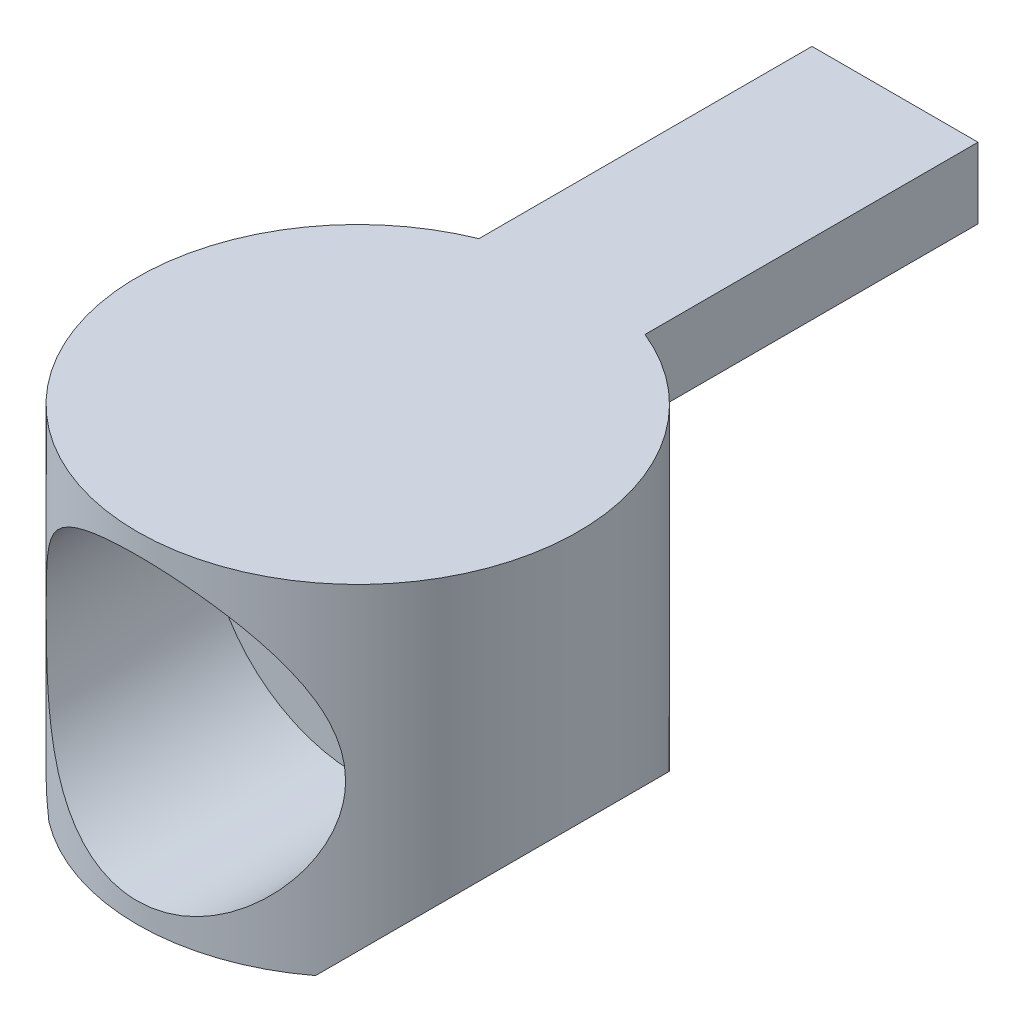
ISO-10303-21;
HEADER;
FILE_DESCRIPTION(('STEP AP214'),'2;1');
FILE_NAME('part.step','',(''),(''),'','','');
FILE_SCHEMA(('AUTOMOTIVE_DESIGN { 1 0 10303 214 1 1 1 1 }'));
ENDSEC;
DATA;
#1=APPLICATION_CONTEXT('core data for automotive mechanical design processes');
#2=APPLICATION_PROTOCOL_DEFINITION('international standard','automotive_design',2000,#1);
#3=PRODUCT_CONTEXT('',#1,'mechanical');
#4=PRODUCT('Part','Part','',(#3));
#5=PRODUCT_RELATED_PRODUCT_CATEGORY('part','',(#4));
#6=PRODUCT_DEFINITION_FORMATION('','',#4);
#7=PRODUCT_DEFINITION_CONTEXT('part definition',#1,'design');
#8=PRODUCT_DEFINITION('design','',#6,#7);
#9=PRODUCT_DEFINITION_SHAPE('','',#8);
#10=(LENGTH_UNIT() NAMED_UNIT(*) SI_UNIT(.MILLI.,.METRE.));
#11=(NAMED_UNIT(*) PLANE_ANGLE_UNIT() SI_UNIT($,.RADIAN.));
#12=(NAMED_UNIT(*) SI_UNIT($,.STERADIAN.) SOLID_ANGLE_UNIT());
#13=UNCERTAINTY_MEASURE_WITH_UNIT(LENGTH_MEASURE(1.E-05),#10,'distance_accuracy_value','');
#14=(GEOMETRIC_REPRESENTATION_CONTEXT(3) GLOBAL_UNCERTAINTY_ASSIGNED_CONTEXT((#13)) GLOBAL_UNIT_ASSIGNED_CONTEXT((#10,
#11,#12)) REPRESENTATION_CONTEXT('',''));
#15=CARTESIAN_POINT('',(0.,0.,0.));
#16=DIRECTION('',(0.,0.,1.));
#17=DIRECTION('',(1.,0.,0.));
#18=AXIS2_PLACEMENT_3D('',#15,#16,#17);
#19=CARTESIAN_POINT('',(0.,-7.9375,-25.0698));
#20=DIRECTION('',(0.,0.,1.));
#21=DIRECTION('',(1.,0.,0.));
#22=AXIS2_PLACEMENT_3D('',#19,#20,#21);
#23=CYLINDRICAL_SURFACE('',#22,4.064);
#24=CARTESIAN_POINT('',(4.064,-7.9375,-9.4501996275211));
#25=CARTESIAN_POINT('',(4.06399919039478,-8.04651797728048,-9.45020042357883));
#26=CARTESIAN_POINT('',(4.05960710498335,-8.15557113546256,-9.45209253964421));
#27=CARTESIAN_POINT('',(4.04208239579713,-8.37288984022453,-9.45959969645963));
#28=CARTESIAN_POINT('',(4.02894432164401,-8.48115485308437,-9.4652170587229));
#29=CARTESIAN_POINT('',(3.99402702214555,-8.69627166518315,-9.4800041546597));
#30=CARTESIAN_POINT('',(3.97223028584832,-8.80312014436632,-9.48918108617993));
#31=CARTESIAN_POINT('',(3.92022725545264,-9.01442920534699,-9.51078180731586));
#32=CARTESIAN_POINT('',(3.89001747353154,-9.1188887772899,-9.52320694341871));
#33=CARTESIAN_POINT('',(3.7874486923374,-9.42675938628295,-9.56467911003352));
#34=CARTESIAN_POINT('',(3.70297765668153,-9.62570831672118,-9.59800074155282));
#35=CARTESIAN_POINT('',(3.50452440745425,-10.0064578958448,-9.67221954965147));
#36=CARTESIAN_POINT('',(3.39054917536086,-10.1882625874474,-9.71311493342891));
#37=CARTESIAN_POINT('',(3.12948589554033,-10.5399466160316,-9.80043577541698));
#38=CARTESIAN_POINT('',(2.98101504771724,-10.7087582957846,-9.8470362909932));
#39=CARTESIAN_POINT('',(2.6580959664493,-11.0198569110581,-9.93906749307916));
#40=CARTESIAN_POINT('',(2.48363880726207,-11.162134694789,-9.98449777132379));
#41=CARTESIAN_POINT('',(2.10547991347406,-11.4214005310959,-10.0711626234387));
#42=CARTESIAN_POINT('',(1.90091385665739,-11.5372109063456,-10.1121697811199));
#43=CARTESIAN_POINT('',(1.47329465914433,-11.7323209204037,-10.1832531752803));
#44=CARTESIAN_POINT('',(1.25024890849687,-11.8116350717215,-10.2133337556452));
#45=CARTESIAN_POINT('',(0.803206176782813,-11.9277041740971,-10.2579367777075));
#46=CARTESIAN_POINT('',(0.579754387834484,-11.9662966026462,-10.273128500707));
#47=CARTESIAN_POINT('',(0.12906452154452,-12.0057374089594,-10.2886577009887));
#48=CARTESIAN_POINT('',(-0.0981721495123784,-12.0065995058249,-10.2890005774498));
#49=CARTESIAN_POINT('',(-0.536721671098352,-11.9715753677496,-10.2752044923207));
#50=CARTESIAN_POINT('',(-0.748224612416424,-11.9377008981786,-10.2618583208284));
#51=CARTESIAN_POINT('',(-1.16226102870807,-11.8375793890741,-10.2232465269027));
#52=CARTESIAN_POINT('',(-1.36479384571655,-11.7713299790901,-10.1979800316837));
#53=CARTESIAN_POINT('',(-1.75876535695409,-11.6075205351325,-10.1375274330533));
#54=CARTESIAN_POINT('',(-1.94999222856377,-11.5095060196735,-10.1021983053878));
#55=CARTESIAN_POINT('',(-2.31377465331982,-11.2853694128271,-10.0251405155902));
#56=CARTESIAN_POINT('',(-2.48632384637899,-11.159237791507,-9.98340968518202));
#57=CARTESIAN_POINT('',(-2.81961635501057,-10.8729992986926,-9.89463326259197));
#58=CARTESIAN_POINT('',(-2.97888947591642,-10.7112305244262,-9.84741846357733));
#59=CARTESIAN_POINT('',(-3.26863935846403,-10.3630739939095,-9.75507779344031));
#60=CARTESIAN_POINT('',(-3.39910715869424,-10.1766786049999,-9.7099525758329));
#61=CARTESIAN_POINT('',(-3.63079088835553,-9.77814410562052,-9.62576626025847));
#62=CARTESIAN_POINT('',(-3.73112301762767,-9.56544627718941,-9.58690152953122));
#63=CARTESIAN_POINT('',(-3.8939659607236,-9.12422993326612,-9.52193134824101));
#64=CARTESIAN_POINT('',(-3.95650062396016,-8.89572149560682,-9.49581785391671));
#65=CARTESIAN_POINT('',(-4.03844408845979,-8.44401177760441,-9.46124786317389));
#66=CARTESIAN_POINT('',(-4.0602132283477,-8.22131340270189,-9.4518268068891));
#67=CARTESIAN_POINT('',(-4.06687698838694,-7.77529510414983,-9.4489636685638));
#68=CARTESIAN_POINT('',(-4.05178236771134,-7.55197538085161,-9.45551692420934));
#69=CARTESIAN_POINT('',(-3.98729450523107,-7.12395373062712,-9.48287612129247));
#70=CARTESIAN_POINT('',(-3.93983256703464,-6.91890323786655,-9.50287866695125));
#71=CARTESIAN_POINT('',(-3.81444745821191,-6.51980340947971,-9.55389486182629));
#72=CARTESIAN_POINT('',(-3.73651763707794,-6.32575648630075,-9.58491091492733));
#73=CARTESIAN_POINT('',(-3.5489248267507,-5.94552569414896,-9.65597825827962));
#74=CARTESIAN_POINT('',(-3.43811772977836,-5.7599663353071,-9.69634119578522));
#75=CARTESIAN_POINT('',(-3.18909477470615,-5.40924590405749,-9.78106957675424));
#76=CARTESIAN_POINT('',(-3.05086797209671,-5.24409301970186,-9.82543661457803));
#77=CARTESIAN_POINT('',(-2.73922058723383,-4.92656716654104,-9.91701688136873));
#78=CARTESIAN_POINT('',(-2.56398695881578,-4.77596016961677,-9.96420603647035));
#79=CARTESIAN_POINT('',(-2.18959931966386,-4.50602826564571,-10.0531088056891));
#80=CARTESIAN_POINT('',(-1.99044453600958,-4.38670436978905,-10.0948222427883));
#81=CARTESIAN_POINT('',(-1.5733491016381,-4.18324538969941,-10.1681699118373));
#82=CARTESIAN_POINT('',(-1.35542676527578,-4.09907645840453,-10.1998138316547));
#83=CARTESIAN_POINT('',(-0.906962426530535,-3.96913295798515,-10.2494177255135));
#84=CARTESIAN_POINT('',(-0.676427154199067,-3.92333812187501,-10.267384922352));
#85=CARTESIAN_POINT('',(-0.225157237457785,-3.87380631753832,-10.2868564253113));
#86=CARTESIAN_POINT('',(-0.00473693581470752,-3.86757016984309,-10.2893388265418));
#87=CARTESIAN_POINT('',(0.433896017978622,-3.89076755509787,-10.28018470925));
#88=CARTESIAN_POINT('',(0.652108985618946,-3.92019591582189,-10.2685502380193));
#89=CARTESIAN_POINT('',(1.07356904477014,-4.0121056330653,-10.2329508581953));
#90=CARTESIAN_POINT('',(1.2770675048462,-4.07359001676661,-10.2093584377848));
#91=CARTESIAN_POINT('',(1.67083446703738,-4.22683026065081,-10.152354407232));
#92=CARTESIAN_POINT('',(1.86110049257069,-4.31859176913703,-10.1189409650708));
#93=CARTESIAN_POINT('',(2.23216078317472,-4.53432296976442,-10.0437660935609));
#94=CARTESIAN_POINT('',(2.41217440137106,-4.65952805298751,-10.0017029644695));
#95=CARTESIAN_POINT('',(2.74938323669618,-4.93672153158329,-9.91431568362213));
#96=CARTESIAN_POINT('',(2.90656929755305,-5.08872062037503,-9.86899023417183));
#97=CARTESIAN_POINT('',(3.20341831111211,-5.42599914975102,-9.77681369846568));
#98=CARTESIAN_POINT('',(3.34146188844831,-5.61272908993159,-9.73003447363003));
#99=CARTESIAN_POINT('',(3.5843542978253,-6.00816064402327,-9.64320857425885));
#100=CARTESIAN_POINT('',(3.68919888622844,-6.21686506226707,-9.60316276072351));
#101=CARTESIAN_POINT('',(3.85441246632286,-6.63179145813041,-9.53798290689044));
#102=CARTESIAN_POINT('',(3.91789358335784,-6.83660221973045,-9.51184366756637));
#103=CARTESIAN_POINT('',(3.98837751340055,-7.14983472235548,-9.48239491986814));
#104=CARTESIAN_POINT('',(4.00774347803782,-7.25516021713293,-9.47420805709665));
#105=CARTESIAN_POINT('',(4.03811320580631,-7.46720182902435,-9.46130530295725));
#106=CARTESIAN_POINT('',(4.04912191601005,-7.57391708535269,-9.4565873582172));
#107=CARTESIAN_POINT('',(4.05859364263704,-7.72361255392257,-9.45252302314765));
#108=CARTESIAN_POINT('',(4.06062031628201,-7.76635679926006,-9.45165243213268));
#109=CARTESIAN_POINT('',(4.06332369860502,-7.85189888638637,-9.45049055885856));
#110=CARTESIAN_POINT('',(4.06400031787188,-7.89469673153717,-9.45019931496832));
#111=CARTESIAN_POINT('',(4.064,-7.9375,-9.4501996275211));
#112=B_SPLINE_CURVE_WITH_KNOTS('',3,(#24,#25,#26,#27,#28,#29,#30,#31,#32,#33,#34,#35,#36,#37,
#38,#39,#40,#41,#42,#43,#44,#45,#46,#47,#48,#49,#50,#51,#52,#53,#54,#55,#56,#57,#58,#59,#60,#61,
#62,#63,#64,#65,#66,#67,#68,#69,#70,#71,#72,#73,#74,#75,#76,#77,#78,#79,#80,#81,#82,#83,#84,#85,
#86,#87,#88,#89,#90,#91,#92,#93,#94,#95,#96,#97,#98,#99,#100,#101,#102,#103,#104,#105,#106,#107,
#108,#109,#110,#111),.UNSPECIFIED.,.T.,.F.,(4,2,2,2,2,2,2,2,2,2,2,2,2,2,2,2,2,2,2,2,2,2,2,2,2,2,
2,2,2,2,2,2,2,2,2,2,2,2,2,2,2,2,2,4),(0.,0.327009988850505,0.654223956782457,0.98210306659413,
1.31011830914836,1.96300003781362,2.61572741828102,3.30145586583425,3.98742039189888,
4.69966446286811,5.41162506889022,6.08987183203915,6.76787197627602,7.4087076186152,
8.0495901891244,8.70008005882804,9.35079073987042,10.0432975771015,10.7360195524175,
11.4474238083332,12.1583787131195,12.8267179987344,13.4948622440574,14.1262730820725,
14.7578218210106,15.4146193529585,16.0716795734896,16.7758621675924,17.4800675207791,
18.1835932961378,18.8867472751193,19.5449955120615,20.2031482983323,20.8419555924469,
21.4808821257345,22.1478124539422,22.8150095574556,23.5222773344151,24.2296354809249,
24.8744687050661,25.1963623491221,25.5180652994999,25.6464493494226,25.77484190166),.UNSPECIFIED.);
#113=CARTESIAN_POINT('',(4.064,-7.9375,-9.4501996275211));
#114=VERTEX_POINT('',#113);
#115=EDGE_CURVE('E420',#114,#114,#112,.T.);
#116=ORIENTED_EDGE('',*,*,#115,.T.);
#117=EDGE_LOOP('',(#116));
#118=FACE_BOUND('',#117,.T.);
#119=CARTESIAN_POINT('',(0.,-7.9375,0.0508000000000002));
#120=DIRECTION('',(0.,0.,1.));
#121=DIRECTION('',(1.,0.,0.));
#122=AXIS2_PLACEMENT_3D('',#119,#120,#121);
#123=CIRCLE('',#122,4.064);
#124=CARTESIAN_POINT('',(4.064,-7.9375,0.0508000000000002));
#125=VERTEX_POINT('',#124);
#126=EDGE_CURVE('E441',#125,#125,#123,.F.);
#127=ORIENTED_EDGE('',*,*,#126,.F.);
#128=EDGE_LOOP('',(#127));
#129=FACE_BOUND('',#128,.T.);
#130=ADVANCED_FACE('F361',(#118,#129),#23,.F.);
#131=CARTESIAN_POINT('',(0.,-15.875,0.));
#132=DIRECTION('',(0.,1.,0.));
#133=DIRECTION('',(0.,0.,1.));
#134=AXIS2_PLACEMENT_3D('',#131,#132,#133);
#135=CYLINDRICAL_SURFACE('',#134,10.287);
#136=CARTESIAN_POINT('',(0.,-14.9225,10.287));
#137=CARTESIAN_POINT('',(0.174767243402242,-14.9224992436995,10.2869992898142));
#138=CARTESIAN_POINT('',(0.349546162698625,-14.9159313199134,10.2825363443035));
#139=CARTESIAN_POINT('',(0.697678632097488,-14.8897621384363,10.2647942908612));
#140=CARTESIAN_POINT('',(0.871032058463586,-14.8701597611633,10.2515144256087));
#141=CARTESIAN_POINT('',(1.21504561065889,-14.8182098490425,10.2164545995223));
#142=CARTESIAN_POINT('',(1.38570408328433,-14.7858547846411,10.1946696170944));
#143=CARTESIAN_POINT('',(1.72298267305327,-14.7088723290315,10.1431164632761));
#144=CARTESIAN_POINT('',(1.88960281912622,-14.6642450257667,10.113348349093));
#145=CARTESIAN_POINT('',(2.21690261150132,-14.5635641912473,10.0466638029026));
#146=CARTESIAN_POINT('',(2.37760846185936,-14.5075707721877,10.0097850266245));
#147=CARTESIAN_POINT('',(2.69314305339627,-14.3846631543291,9.92954683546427));
#148=CARTESIAN_POINT('',(2.84796947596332,-14.3177447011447,9.8861848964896));
#149=CARTESIAN_POINT('',(3.30239515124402,-14.1016508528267,9.74764553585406));
#150=CARTESIAN_POINT('',(3.59223487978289,-13.9370450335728,9.64395234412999));
#151=CARTESIAN_POINT('',(4.1651402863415,-13.5562544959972,9.41157959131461));
#152=CARTESIAN_POINT('',(4.44546680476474,-13.3368461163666,9.28151649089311));
#153=CARTESIAN_POINT('',(4.96803495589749,-12.8603089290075,9.01262083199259));
#154=CARTESIAN_POINT('',(5.21021988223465,-12.6031250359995,8.87377563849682));
#155=CARTESIAN_POINT('',(5.5609178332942,-12.1693538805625,8.6557362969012));
#156=CARTESIAN_POINT('',(5.68303836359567,-12.0039192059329,8.57582806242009));
#157=CARTESIAN_POINT('',(5.91286413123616,-11.661841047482,8.41901001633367));
#158=CARTESIAN_POINT('',(6.02056592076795,-11.4851948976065,8.34210092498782));
#159=CARTESIAN_POINT('',(6.22056332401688,-11.1214954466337,8.194048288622));
#160=CARTESIAN_POINT('',(6.31288352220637,-10.9344594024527,8.1228956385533));
#161=CARTESIAN_POINT('',(6.48135067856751,-10.5502171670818,7.98911997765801));
#162=CARTESIAN_POINT('',(6.55749732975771,-10.3530107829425,7.92649712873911));
#163=CARTESIAN_POINT('',(6.67227625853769,-10.0095263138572,7.82987459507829));
#164=CARTESIAN_POINT('',(6.71532978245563,-9.86554956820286,7.79290183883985));
#165=CARTESIAN_POINT('',(6.79235459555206,-9.57362814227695,7.72585902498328));
#166=CARTESIAN_POINT('',(6.82632846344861,-9.42568460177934,7.69578700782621));
#167=CARTESIAN_POINT('',(6.88469686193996,-9.12675532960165,7.64361521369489));
#168=CARTESIAN_POINT('',(6.90910551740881,-8.97577443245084,7.62150368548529));
#169=CARTESIAN_POINT('',(6.94801959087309,-8.67150763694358,7.58604574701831));
#170=CARTESIAN_POINT('',(6.96252497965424,-8.51822173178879,7.57269936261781));
#171=CARTESIAN_POINT('',(6.98140988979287,-8.20976177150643,7.55529311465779));
#172=CARTESIAN_POINT('',(6.98574108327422,-8.0545822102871,7.55127757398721));
#173=CARTESIAN_POINT('',(6.98405171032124,-7.74433031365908,7.55283992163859));
#174=CARTESIAN_POINT('',(6.97803113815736,-7.58925797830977,7.55841781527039));
#175=CARTESIAN_POINT('',(6.95574608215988,-7.28038020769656,7.57893097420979));
#176=CARTESIAN_POINT('',(6.93947521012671,-7.12657562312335,7.5938720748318));
#177=CARTESIAN_POINT('',(6.89699243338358,-6.82149335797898,7.63247480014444));
#178=CARTESIAN_POINT('',(6.87078030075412,-6.67021573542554,7.65613662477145));
#179=CARTESIAN_POINT('',(6.7810629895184,-6.23718647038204,7.73600755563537));
#180=CARTESIAN_POINT('',(6.70517296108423,-5.95977724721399,7.80239699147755));
#181=CARTESIAN_POINT('',(6.52235681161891,-5.42152088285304,7.95583678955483));
#182=CARTESIAN_POINT('',(6.41540667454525,-5.16068674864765,8.04290312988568));
#183=CARTESIAN_POINT('',(6.20438735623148,-4.72208380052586,8.20615188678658));
#184=CARTESIAN_POINT('',(6.10658965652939,-4.54014421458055,8.27941465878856));
#185=CARTESIAN_POINT('',(5.89623565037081,-4.18691309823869,8.43051235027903));
#186=CARTESIAN_POINT('',(5.78367390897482,-4.01562552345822,8.50834894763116));
#187=CARTESIAN_POINT('',(5.54430317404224,-3.68393348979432,8.66623725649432));
#188=CARTESIAN_POINT('',(5.41747098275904,-3.52354745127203,8.74629241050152));
#189=CARTESIAN_POINT('',(5.15023849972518,-3.21447184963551,8.90627092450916));
#190=CARTESIAN_POINT('',(5.0098397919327,-3.06578092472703,8.98619429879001));
#191=CARTESIAN_POINT('',(4.71463843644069,-2.77949194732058,9.14455310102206));
#192=CARTESIAN_POINT('',(4.55972184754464,-2.64200080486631,9.22296971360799));
#193=CARTESIAN_POINT('',(4.23699414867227,-2.38041020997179,9.37561258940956));
#194=CARTESIAN_POINT('',(4.06918191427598,-2.256311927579,9.44983848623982));
#195=CARTESIAN_POINT('',(3.72160444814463,-2.02280311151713,9.59203967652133));
#196=CARTESIAN_POINT('',(3.54186107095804,-1.91336677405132,9.66002588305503));
#197=CARTESIAN_POINT('',(3.17103463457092,-1.71018713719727,9.78802047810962));
#198=CARTESIAN_POINT('',(2.9799550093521,-1.61643911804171,9.84803126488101));
#199=CARTESIAN_POINT('',(2.63115393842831,-1.46486728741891,9.94608300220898));
#200=CARTESIAN_POINT('',(2.47542306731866,-1.40368625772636,9.986045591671));
#201=CARTESIAN_POINT('',(2.15857566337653,-1.29227903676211,10.0592913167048));
#202=CARTESIAN_POINT('',(1.99746019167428,-1.2420507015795,10.0925757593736));
#203=CARTESIAN_POINT('',(1.67081859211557,-1.15316329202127,10.1517618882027));
#204=CARTESIAN_POINT('',(1.50529460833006,-1.1144987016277,10.1776670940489));
#205=CARTESIAN_POINT('',(1.17083806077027,-1.04922076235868,10.221543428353));
#206=CARTESIAN_POINT('',(1.00190541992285,-1.02260768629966,10.2395143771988));
#207=CARTESIAN_POINT('',(0.661287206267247,-0.98175099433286,10.2671495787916));
#208=CARTESIAN_POINT('',(0.489594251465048,-0.967549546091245,10.2767855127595));
#209=CARTESIAN_POINT('',(0.145358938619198,-0.951887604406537,10.2874142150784));
#210=CARTESIAN_POINT('',(-0.0271834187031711,-0.950427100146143,10.2884069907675));
#211=CARTESIAN_POINT('',(-0.371741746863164,-0.960269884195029,10.2817251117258));
#212=CARTESIAN_POINT('',(-0.543757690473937,-0.971573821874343,10.2740500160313));
#213=CARTESIAN_POINT('',(-0.885895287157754,-1.00677217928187,10.2502177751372));
#214=CARTESIAN_POINT('',(-1.05601698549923,-1.03066629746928,10.2340608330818));
#215=CARTESIAN_POINT('',(-1.38417793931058,-1.08910088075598,10.1947179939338));
#216=CARTESIAN_POINT('',(-1.54238036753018,-1.12301147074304,10.1719490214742));
#217=CARTESIAN_POINT('',(-1.85504509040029,-1.20140181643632,10.1196003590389));
#218=CARTESIAN_POINT('',(-2.00950608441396,-1.24588519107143,10.0900183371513));
#219=CARTESIAN_POINT('',(-2.31375718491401,-1.34490257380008,10.0246248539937));
#220=CARTESIAN_POINT('',(-2.46354859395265,-1.39943374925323,9.98881514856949));
#221=CARTESIAN_POINT('',(-2.7578701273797,-1.51803228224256,9.91159345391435));
#222=CARTESIAN_POINT('',(-2.90239821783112,-1.58210327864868,9.8701793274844));
#223=CARTESIAN_POINT('',(-3.19701314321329,-1.72475283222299,9.77891220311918));
#224=CARTESIAN_POINT('',(-3.34660853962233,-1.80408460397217,9.72864801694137));
#225=CARTESIAN_POINT('',(-3.63841798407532,-1.97255581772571,9.62332553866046));
#226=CARTESIAN_POINT('',(-3.78062927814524,-2.06169888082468,9.56826547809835));
#227=CARTESIAN_POINT('',(-4.19565569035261,-2.34300779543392,9.39724356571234));
#228=CARTESIAN_POINT('',(-4.4568974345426,-2.54907005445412,9.27542907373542));
#229=CARTESIAN_POINT('',(-4.8437102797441,-2.90103856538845,9.07671061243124));
#230=CARTESIAN_POINT('',(-4.98051214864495,-3.03631108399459,9.00220374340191));
#231=CARTESIAN_POINT('',(-5.24235254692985,-3.31745278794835,8.85227786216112));
#232=CARTESIAN_POINT('',(-5.36738923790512,-3.46332362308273,8.77685870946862));
#233=CARTESIAN_POINT('',(-5.60529644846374,-3.7652280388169,8.62686631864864));
#234=CARTESIAN_POINT('',(-5.71815944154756,-3.92126781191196,8.55229362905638));
#235=CARTESIAN_POINT('',(-5.93111593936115,-4.2430069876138,8.40600401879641));
#236=CARTESIAN_POINT('',(-6.03121553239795,-4.40870172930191,8.33428574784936));
#237=CARTESIAN_POINT('',(-6.20487180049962,-4.72539188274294,8.2056026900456));
#238=CARTESIAN_POINT('',(-6.28018073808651,-4.87516177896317,8.14798416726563));
#239=CARTESIAN_POINT('',(-6.42045256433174,-5.18134926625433,8.03791678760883));
#240=CARTESIAN_POINT('',(-6.48541459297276,-5.33776740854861,7.98546836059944));
#241=CARTESIAN_POINT('',(-6.60427965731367,-5.65657643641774,7.88744505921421));
#242=CARTESIAN_POINT('',(-6.65819890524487,-5.81895814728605,7.84186013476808));
#243=CARTESIAN_POINT('',(-6.75438025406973,-6.14917349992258,7.75917176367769));
#244=CARTESIAN_POINT('',(-6.79664942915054,-6.31700376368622,7.72206317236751));
#245=CARTESIAN_POINT('',(-6.86300111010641,-6.62957667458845,7.66310777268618));
#246=CARTESIAN_POINT('',(-6.88892163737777,-6.77364733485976,7.63976164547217));
#247=CARTESIAN_POINT('',(-6.93173586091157,-7.06411769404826,7.60093723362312));
#248=CARTESIAN_POINT('',(-6.9486339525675,-7.21051622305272,7.5854551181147));
#249=CARTESIAN_POINT('',(-6.97313717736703,-7.50466111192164,7.5629363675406));
#250=CARTESIAN_POINT('',(-6.98074737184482,-7.65240669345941,7.55589513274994));
#251=CARTESIAN_POINT('',(-6.98655849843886,-7.94824548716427,7.55052213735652));
#252=CARTESIAN_POINT('',(-6.98475923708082,-8.09633870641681,7.55219055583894));
#253=CARTESIAN_POINT('',(-6.97178530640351,-8.39165756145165,7.5641694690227));
#254=CARTESIAN_POINT('',(-6.96061725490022,-8.5388837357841,7.57447386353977));
#255=CARTESIAN_POINT('',(-6.92911652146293,-8.83150772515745,7.60329842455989));
#256=CARTESIAN_POINT('',(-6.90878390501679,-8.97690555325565,7.62181853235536));
#257=CARTESIAN_POINT('',(-6.83443640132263,-9.40928699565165,7.68878634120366));
#258=CARTESIAN_POINT('',(-6.76707917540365,-9.69230256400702,7.74863407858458));
#259=CARTESIAN_POINT('',(-6.57315914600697,-10.330901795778,7.91433514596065));
#260=CARTESIAN_POINT('',(-6.4345219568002,-10.6805492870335,8.02879421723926));
#261=CARTESIAN_POINT('',(-6.18960112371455,-11.179970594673,8.21717171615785));
#262=CARTESIAN_POINT('',(-6.10167863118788,-11.3424402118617,8.28283008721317));
#263=CARTESIAN_POINT('',(-5.91401497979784,-11.6588496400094,8.41784603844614));
#264=CARTESIAN_POINT('',(-5.81427463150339,-11.8127900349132,8.4872033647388));
#265=CARTESIAN_POINT('',(-5.6014025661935,-12.1147392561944,8.6292155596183));
#266=CARTESIAN_POINT('',(-5.48804444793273,-12.2625698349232,8.70190854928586));
#267=CARTESIAN_POINT('',(-5.24994334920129,-12.548677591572,8.84759554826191));
#268=CARTESIAN_POINT('',(-5.12519751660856,-12.6869523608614,8.92058962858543));
#269=CARTESIAN_POINT('',(-4.86467510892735,-12.9534633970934,9.06529152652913));
#270=CARTESIAN_POINT('',(-4.72889719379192,-13.0816984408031,9.13699918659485));
#271=CARTESIAN_POINT('',(-4.44665036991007,-13.3275422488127,9.27763637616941));
#272=CARTESIAN_POINT('',(-4.30017984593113,-13.4451494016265,9.34656548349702));
#273=CARTESIAN_POINT('',(-3.97818675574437,-13.6828541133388,9.48846941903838));
#274=CARTESIAN_POINT('',(-3.8013116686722,-13.8014602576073,9.56089002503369));
#275=CARTESIAN_POINT('',(-3.43542512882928,-14.0230393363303,9.69837051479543));
#276=CARTESIAN_POINT('',(-3.24641963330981,-14.1260198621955,9.763433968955));
#277=CARTESIAN_POINT('',(-2.8575541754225,-14.3149024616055,9.88423713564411));
#278=CARTESIAN_POINT('',(-2.65771034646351,-14.4008290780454,9.93999022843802));
#279=CARTESIAN_POINT('',(-2.24846359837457,-14.5543221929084,10.0404735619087));
#280=CARTESIAN_POINT('',(-2.03906522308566,-14.6218973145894,10.0852089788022));
#281=CARTESIAN_POINT('',(-1.67871039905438,-14.7194938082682,10.1502074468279));
#282=CARTESIAN_POINT('',(-1.5297176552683,-14.7546654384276,10.1737597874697));
#283=CARTESIAN_POINT('',(-1.22891015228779,-14.815255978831,10.2144585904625));
#284=CARTESIAN_POINT('',(-1.07709593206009,-14.8406767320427,10.2316062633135));
#285=CARTESIAN_POINT('',(-0.771540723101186,-14.8814689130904,10.2591726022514));
#286=CARTESIAN_POINT('',(-0.617800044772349,-14.896841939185,10.2695923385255));
#287=CARTESIAN_POINT('',(-0.309375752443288,-14.9173562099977,10.2835052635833));
#288=CARTESIAN_POINT('',(-0.154692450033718,-14.9225006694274,10.2870006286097));
#289=CARTESIAN_POINT('',(0.,-14.9225,10.287));
#290=B_SPLINE_CURVE_WITH_KNOTS('',3,(#136,#137,#138,#139,#140,#141,#142,#143,#144,#145,#146,
#147,#148,#149,#150,#151,#152,#153,#154,#155,#156,#157,#158,#159,#160,#161,#162,#163,#164,#165,
#166,#167,#168,#169,#170,#171,#172,#173,#174,#175,#176,#177,#178,#179,#180,#181,#182,#183,#184,
#185,#186,#187,#188,#189,#190,#191,#192,#193,#194,#195,#196,#197,#198,#199,#200,#201,#202,#203,
#204,#205,#206,#207,#208,#209,#210,#211,#212,#213,#214,#215,#216,#217,#218,#219,#220,#221,#222,
#223,#224,#225,#226,#227,#228,#229,#230,#231,#232,#233,#234,#235,#236,#237,#238,#239,#240,#241,
#242,#243,#244,#245,#246,#247,#248,#249,#250,#251,#252,#253,#254,#255,#256,#257,#258,#259,#260,
#261,#262,#263,#264,#265,#266,#267,#268,#269,#270,#271,#272,#273,#274,#275,#276,#277,#278,#279,
#280,#281,#282,#283,#284,#285,#286,#287,#288,#289),.UNSPECIFIED.,.T.,.F.,(4,2,2,2,2,2,2,2,2,2,2,
2,2,2,2,2,2,2,2,2,2,2,2,2,2,2,2,2,2,2,2,2,2,2,2,2,2,2,2,2,2,2,2,2,2,2,2,2,2,2,2,2,2,2,2,2,2,2,2,
2,2,2,2,2,2,2,2,2,2,2,2,2,2,2,2,2,4),(0.,0.524143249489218,1.04833152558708,1.57282976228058,
2.09732424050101,2.61911388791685,3.14110721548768,4.18416131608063,5.31715608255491,
6.45181972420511,7.1129904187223,7.77431893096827,8.43458008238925,9.09485376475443,
9.55871083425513,10.022436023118,10.4854738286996,10.9485130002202,11.4137472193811,
11.8789816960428,12.3445064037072,12.8100417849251,13.6920305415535,14.5747030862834,
15.2314127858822,15.8883649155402,16.5464008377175,17.2043600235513,17.8680024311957,
18.5317027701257,19.1942192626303,19.8565360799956,20.3720901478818,20.8875432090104,
21.4027500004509,21.9179684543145,22.4349305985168,22.9518923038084,23.4688803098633,
23.985855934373,24.4754906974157,24.9652932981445,25.4549580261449,25.944810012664,
26.4741597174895,27.0037054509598,28.0626795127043,28.6811363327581,29.2996896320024,
29.9186231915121,30.5372603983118,31.068593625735,31.5999709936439,32.1305625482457,
32.6608312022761,33.1050669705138,33.5490861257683,33.9928632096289,34.4366494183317,
34.8801224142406,35.3235922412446,36.2109950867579,37.383808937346,37.9715571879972,
38.5592651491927,39.1586317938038,39.7581489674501,40.3577390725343,40.9574199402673,
41.6312788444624,42.3048093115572,42.9773633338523,43.6496007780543,44.1138453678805,
44.5780021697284,45.0420851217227,45.5060221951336),.UNSPECIFIED.);
#291=CARTESIAN_POINT('',(0.,-14.9225,10.287));
#292=VERTEX_POINT('',#291);
#293=EDGE_CURVE('E12',#292,#292,#290,.T.);
#294=ORIENTED_EDGE('',*,*,#293,.F.);
#295=EDGE_LOOP('',(#294));
#296=FACE_BOUND('',#295,.T.);
#297=ORIENTED_EDGE('',*,*,#115,.F.);
#298=EDGE_LOOP('',(#297));
#299=FACE_BOUND('',#298,.T.);
#300=CARTESIAN_POINT('',(0.,-22.098,0.));
#301=DIRECTION('',(0.707106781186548,0.707106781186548,0.));
#302=DIRECTION('',(-0.707106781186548,0.707106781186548,0.));
#303=AXIS2_PLACEMENT_3D('',#300,#301,#302);
#304=ELLIPSE('',#303,14.548014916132,10.287);
#305=CARTESIAN_POINT('',(-6.223,-15.875,8.19125387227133));
#306=VERTEX_POINT('',#305);
#307=CARTESIAN_POINT('',(-6.223,-15.875,-8.19125387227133));
#308=VERTEX_POINT('',#307);
#309=EDGE_CURVE('E379',#306,#308,#304,.F.);
#310=ORIENTED_EDGE('',*,*,#309,.F.);
#311=CARTESIAN_POINT('',(0.,-15.875,0.));
#312=DIRECTION('',(0.,1.,0.));
#313=DIRECTION('',(0.,0.,1.));
#314=AXIS2_PLACEMENT_3D('',#311,#312,#313);
#315=CIRCLE('',#314,10.287);
#316=CARTESIAN_POINT('',(6.223,-15.875,8.19125387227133));
#317=VERTEX_POINT('',#316);
#318=EDGE_CURVE('E386',#306,#317,#315,.T.);
#319=ORIENTED_EDGE('',*,*,#318,.T.);
#320=CARTESIAN_POINT('',(0.,-22.098,0.));
#321=DIRECTION('',(-0.707106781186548,0.707106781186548,0.));
#322=DIRECTION('',(0.707106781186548,0.707106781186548,0.));
#323=AXIS2_PLACEMENT_3D('',#320,#321,#322);
#324=ELLIPSE('',#323,14.548014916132,10.287);
#325=CARTESIAN_POINT('',(6.223,-15.875,-8.19125387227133));
#326=VERTEX_POINT('',#325);
#327=EDGE_CURVE('E419',#326,#317,#324,.F.);
#328=ORIENTED_EDGE('',*,*,#327,.F.);
#329=EDGE_CURVE('E418',#326,#308,#315,.T.);
#330=ORIENTED_EDGE('',*,*,#329,.T.);
#331=EDGE_LOOP('',(#310,#319,#328,#330));
#332=FACE_BOUND('',#331,.T.);
#333=DIRECTION('',(0.,1.,0.));
#334=VECTOR('',#333,1.);
#335=CARTESIAN_POINT('',(-3.8735,-3.302,-9.52986708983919));
#336=LINE('',#335,#334);
#337=CARTESIAN_POINT('',(-3.8735,-3.302,-9.52986708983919));
#338=VERTEX_POINT('',#337);
#339=CARTESIAN_POINT('',(-3.8735,0.,-9.52986708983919));
#340=VERTEX_POINT('',#339);
#341=EDGE_CURVE('E432',#338,#340,#336,.T.);
#342=ORIENTED_EDGE('',*,*,#341,.F.);
#343=CARTESIAN_POINT('',(0.,-3.302,0.));
#344=DIRECTION('',(0.,-1.,0.));
#345=DIRECTION('',(0.,0.,1.));
#346=AXIS2_PLACEMENT_3D('',#343,#344,#345);
#347=CIRCLE('',#346,10.287);
#348=CARTESIAN_POINT('',(3.8735,-3.302,-9.52986708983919));
#349=VERTEX_POINT('',#348);
#350=EDGE_CURVE('E505',#338,#349,#347,.T.);
#351=ORIENTED_EDGE('',*,*,#350,.T.);
#352=DIRECTION('',(0.,1.,0.));
#353=VECTOR('',#352,1.);
#354=CARTESIAN_POINT('',(3.8735,-3.302,-9.52986708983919));
#355=LINE('',#354,#353);
#356=CARTESIAN_POINT('',(3.8735,0.,-9.52986708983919));
#357=VERTEX_POINT('',#356);
#358=EDGE_CURVE('E517',#349,#357,#355,.T.);
#359=ORIENTED_EDGE('',*,*,#358,.T.);
#360=CARTESIAN_POINT('',(0.,0.,0.));
#361=DIRECTION('',(0.,1.,0.));
#362=DIRECTION('',(0.,0.,1.));
#363=AXIS2_PLACEMENT_3D('',#360,#361,#362);
#364=CIRCLE('',#363,10.287);
#365=EDGE_CURVE('E429',#340,#357,#364,.T.);
#366=ORIENTED_EDGE('',*,*,#365,.F.);
#367=EDGE_LOOP('',(#342,#351,#359,#366));
#368=FACE_BOUND('',#367,.T.);
#369=ADVANCED_FACE('F363',(#296,#299,#332,#368),#135,.T.);
#370=CARTESIAN_POINT('',(0.,-15.875,0.));
#371=DIRECTION('',(0.,1.,0.));
#372=DIRECTION('',(0.,0.,1.));
#373=AXIS2_PLACEMENT_3D('',#370,#371,#372);
#374=PLANE('',#373);
#375=ORIENTED_EDGE('',*,*,#318,.F.);
#376=DIRECTION('',(0.,0.,-1.));
#377=VECTOR('',#376,1.);
#378=CARTESIAN_POINT('',(-6.223,-15.875,0.));
#379=LINE('',#378,#377);
#380=EDGE_CURVE('E373',#306,#308,#379,.T.);
#381=ORIENTED_EDGE('',*,*,#380,.T.);
#382=ORIENTED_EDGE('',*,*,#329,.F.);
#383=DIRECTION('',(0.,0.,1.));
#384=VECTOR('',#383,1.);
#385=CARTESIAN_POINT('',(6.223,-15.875,0.));
#386=LINE('',#385,#384);
#387=EDGE_CURVE('E424',#326,#317,#386,.T.);
#388=ORIENTED_EDGE('',*,*,#387,.T.);
#389=EDGE_LOOP('',(#375,#381,#382,#388));
#390=FACE_BOUND('',#389,.T.);
#391=ADVANCED_FACE('F427',(#390),#374,.F.);
#392=CARTESIAN_POINT('',(0.,0.,0.));
#393=DIRECTION('',(0.,1.,0.));
#394=DIRECTION('',(0.,0.,1.));
#395=AXIS2_PLACEMENT_3D('',#392,#393,#394);
#396=PLANE('',#395);
#397=ORIENTED_EDGE('',*,*,#365,.T.);
#398=DIRECTION('',(0.,0.,-1.));
#399=VECTOR('',#398,1.);
#400=CARTESIAN_POINT('',(3.8735,0.,-25.0698));
#401=LINE('',#400,#399);
#402=CARTESIAN_POINT('',(3.8735,0.,-25.0698));
#403=VERTEX_POINT('',#402);
#404=EDGE_CURVE('E497',#357,#403,#401,.T.);
#405=ORIENTED_EDGE('',*,*,#404,.T.);
#406=DIRECTION('',(-1.,0.,0.));
#407=VECTOR('',#406,1.);
#408=CARTESIAN_POINT('',(-3.8735,0.,-25.0698));
#409=LINE('',#408,#407);
#410=CARTESIAN_POINT('',(-3.8735,0.,-25.0698));
#411=VERTEX_POINT('',#410);
#412=EDGE_CURVE('E500',#403,#411,#409,.T.);
#413=ORIENTED_EDGE('',*,*,#412,.T.);
#414=DIRECTION('',(0.,0.,1.));
#415=VECTOR('',#414,1.);
#416=CARTESIAN_POINT('',(-3.8735,0.,-9.52986708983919));
#417=LINE('',#416,#415);
#418=EDGE_CURVE('E503',#411,#340,#417,.T.);
#419=ORIENTED_EDGE('',*,*,#418,.T.);
#420=EDGE_LOOP('',(#397,#405,#413,#419));
#421=FACE_BOUND('',#420,.T.);
#422=ADVANCED_FACE('F465',(#421),#396,.T.);
#423=CARTESIAN_POINT('',(-3.8735,-3.302,-9.52986708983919));
#424=DIRECTION('',(-1.,0.,0.));
#425=DIRECTION('',(0.,0.,1.));
#426=AXIS2_PLACEMENT_3D('',#423,#424,#425);
#427=PLANE('',#426);
#428=ORIENTED_EDGE('',*,*,#418,.F.);
#429=DIRECTION('',(0.,1.,0.));
#430=VECTOR('',#429,1.);
#431=CARTESIAN_POINT('',(-3.8735,-3.302,-25.0698));
#432=LINE('',#431,#430);
#433=CARTESIAN_POINT('',(-3.8735,-3.302,-25.0698));
#434=VERTEX_POINT('',#433);
#435=EDGE_CURVE('E520',#434,#411,#432,.T.);
#436=ORIENTED_EDGE('',*,*,#435,.F.);
#437=DIRECTION('',(0.,0.,1.));
#438=VECTOR('',#437,1.);
#439=CARTESIAN_POINT('',(-3.8735,-3.302,-9.52986708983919));
#440=LINE('',#439,#438);
#441=EDGE_CURVE('E514',#434,#338,#440,.T.);
#442=ORIENTED_EDGE('',*,*,#441,.T.);
#443=ORIENTED_EDGE('',*,*,#341,.T.);
#444=EDGE_LOOP('',(#428,#436,#442,#443));
#445=FACE_BOUND('',#444,.T.);
#446=ADVANCED_FACE('F461',(#445),#427,.T.);
#447=CARTESIAN_POINT('',(-3.8735,-3.302,-25.0698));
#448=DIRECTION('',(0.,0.,-1.));
#449=DIRECTION('',(-1.,0.,0.));
#450=AXIS2_PLACEMENT_3D('',#447,#448,#449);
#451=PLANE('',#450);
#452=ORIENTED_EDGE('',*,*,#412,.F.);
#453=DIRECTION('',(0.,1.,0.));
#454=VECTOR('',#453,1.);
#455=CARTESIAN_POINT('',(3.8735,-3.302,-25.0698));
#456=LINE('',#455,#454);
#457=CARTESIAN_POINT('',(3.8735,-3.302,-25.0698));
#458=VERTEX_POINT('',#457);
#459=EDGE_CURVE('E522',#458,#403,#456,.T.);
#460=ORIENTED_EDGE('',*,*,#459,.F.);
#461=DIRECTION('',(-1.,0.,0.));
#462=VECTOR('',#461,1.);
#463=CARTESIAN_POINT('',(-3.8735,-3.302,-25.0698));
#464=LINE('',#463,#462);
#465=EDGE_CURVE('E511',#458,#434,#464,.T.);
#466=ORIENTED_EDGE('',*,*,#465,.T.);
#467=ORIENTED_EDGE('',*,*,#435,.T.);
#468=EDGE_LOOP('',(#452,#460,#466,#467));
#469=FACE_BOUND('',#468,.T.);
#470=ADVANCED_FACE('F464',(#469),#451,.T.);
#471=CARTESIAN_POINT('',(3.8735,-3.302,-25.0698));
#472=DIRECTION('',(1.,0.,0.));
#473=DIRECTION('',(0.,0.,-1.));
#474=AXIS2_PLACEMENT_3D('',#471,#472,#473);
#475=PLANE('',#474);
#476=ORIENTED_EDGE('',*,*,#404,.F.);
#477=ORIENTED_EDGE('',*,*,#358,.F.);
#478=DIRECTION('',(0.,0.,-1.));
#479=VECTOR('',#478,1.);
#480=CARTESIAN_POINT('',(3.8735,-3.302,-25.0698));
#481=LINE('',#480,#479);
#482=EDGE_CURVE('E508',#349,#458,#481,.T.);
#483=ORIENTED_EDGE('',*,*,#482,.T.);
#484=ORIENTED_EDGE('',*,*,#459,.T.);
#485=EDGE_LOOP('',(#476,#477,#483,#484));
#486=FACE_BOUND('',#485,.T.);
#487=ADVANCED_FACE('F459',(#486),#475,.T.);
#488=CARTESIAN_POINT('',(0.,-3.302,0.));
#489=DIRECTION('',(0.,1.,0.));
#490=DIRECTION('',(0.,0.,1.));
#491=AXIS2_PLACEMENT_3D('',#488,#489,#490);
#492=PLANE('',#491);
#493=ORIENTED_EDGE('',*,*,#350,.F.);
#494=ORIENTED_EDGE('',*,*,#441,.F.);
#495=ORIENTED_EDGE('',*,*,#465,.F.);
#496=ORIENTED_EDGE('',*,*,#482,.F.);
#497=EDGE_LOOP('',(#493,#494,#495,#496));
#498=FACE_BOUND('',#497,.T.);
#499=ADVANCED_FACE('F455',(#498),#492,.F.);
#500=CARTESIAN_POINT('',(6.223,-15.875,-25.0698));
#501=DIRECTION('',(-0.707106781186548,0.707106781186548,0.));
#502=DIRECTION('',(-0.707106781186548,-0.707106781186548,0.));
#503=AXIS2_PLACEMENT_3D('',#500,#501,#502);
#504=PLANE('',#503);
#505=ORIENTED_EDGE('',*,*,#327,.T.);
#506=ORIENTED_EDGE('',*,*,#387,.F.);
#507=EDGE_LOOP('',(#505,#506));
#508=FACE_BOUND('',#507,.T.);
#509=ADVANCED_FACE('F452',(#508),#504,.F.);
#510=CARTESIAN_POINT('',(-6.223,-15.875,-25.0698));
#511=DIRECTION('',(0.707106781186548,0.707106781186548,0.));
#512=DIRECTION('',(-0.707106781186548,0.707106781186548,0.));
#513=AXIS2_PLACEMENT_3D('',#510,#511,#512);
#514=PLANE('',#513);
#515=ORIENTED_EDGE('',*,*,#309,.T.);
#516=ORIENTED_EDGE('',*,*,#380,.F.);
#517=EDGE_LOOP('',(#515,#516));
#518=FACE_BOUND('',#517,.T.);
#519=ADVANCED_FACE('F422',(#518),#514,.F.);
#520=CARTESIAN_POINT('',(0.,0.,0.0508));
#521=DIRECTION('',(0.,0.,1.));
#522=DIRECTION('',(1.,0.,0.));
#523=AXIS2_PLACEMENT_3D('',#520,#521,#522);
#524=PLANE('',#523);
#525=CARTESIAN_POINT('',(0.,-7.9375,0.0508000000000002));
#526=DIRECTION('',(0.,0.,1.));
#527=DIRECTION('',(1.,0.,0.));
#528=AXIS2_PLACEMENT_3D('',#525,#526,#527);
#529=CIRCLE('',#528,6.985);
#530=CARTESIAN_POINT('',(6.985,-7.9375,0.0508000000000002));
#531=VERTEX_POINT('',#530);
#532=EDGE_CURVE('E490',#531,#531,#529,.F.);
#533=ORIENTED_EDGE('',*,*,#532,.F.);
#534=EDGE_LOOP('',(#533));
#535=FACE_BOUND('',#534,.T.);
#536=ORIENTED_EDGE('',*,*,#126,.T.);
#537=EDGE_LOOP('',(#536));
#538=FACE_BOUND('',#537,.T.);
#539=ADVANCED_FACE('F451',(#535,#538),#524,.T.);
#540=CARTESIAN_POINT('',(0.,-7.9375,-19.7565634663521));
#541=DIRECTION('',(0.,0.,1.));
#542=DIRECTION('',(1.,0.,0.));
#543=AXIS2_PLACEMENT_3D('',#540,#541,#542);
#544=CYLINDRICAL_SURFACE('',#543,6.985);
#545=ORIENTED_EDGE('',*,*,#293,.T.);
#546=EDGE_LOOP('',(#545));
#547=FACE_BOUND('',#546,.T.);
#548=ORIENTED_EDGE('',*,*,#532,.T.);
#549=EDGE_LOOP('',(#548));
#550=FACE_BOUND('',#549,.T.);
#551=ADVANCED_FACE('F446',(#547,#550),#544,.F.);
#552=CLOSED_SHELL('',(#130,#369,#391,#422,#446,#470,#487,#499,#509,#519,#539,#551));
#553=MANIFOLD_SOLID_BREP('B2',#552);
#554=ADVANCED_BREP_SHAPE_REPRESENTATION('',(#18,#553),#14);
#555=SHAPE_DEFINITION_REPRESENTATION(#9,#554);
ENDSEC;
END-ISO-10303-21;
